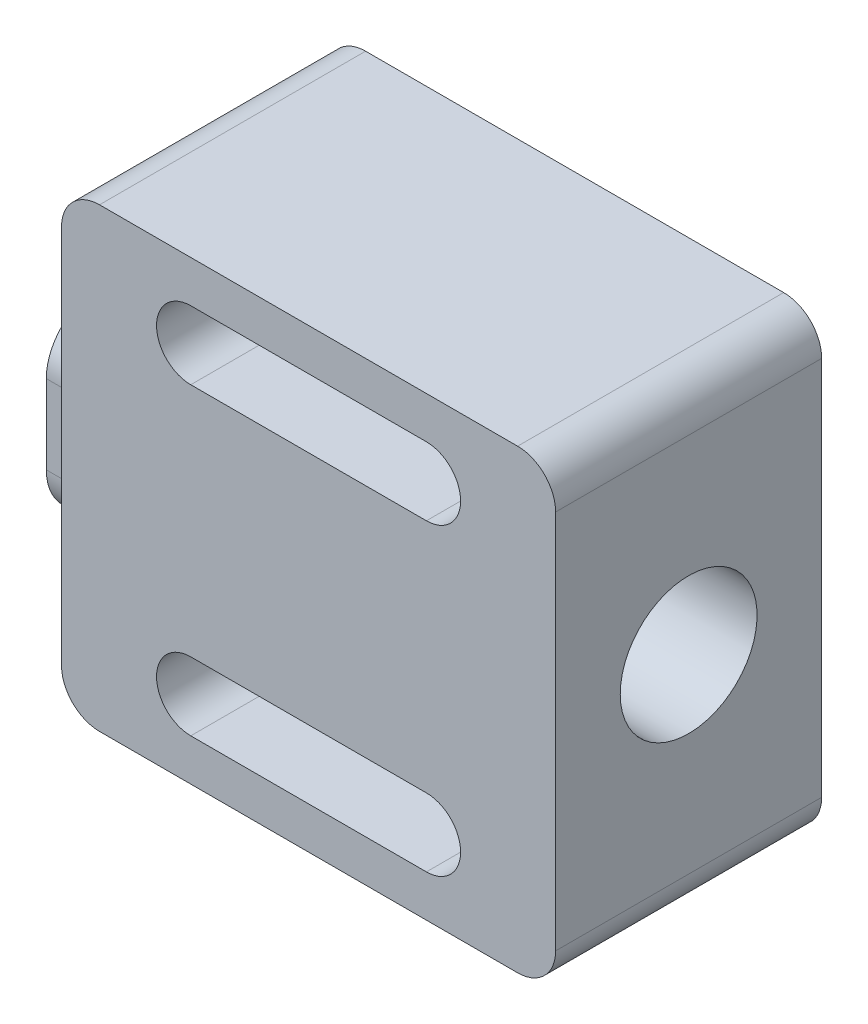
ISO-10303-21;
HEADER;
FILE_DESCRIPTION(('STEP AP214'),'2;1');
FILE_NAME('part.step','',(''),(''),'','','');
FILE_SCHEMA(('AUTOMOTIVE_DESIGN { 1 0 10303 214 1 1 1 1 }'));
ENDSEC;
DATA;
#1=APPLICATION_CONTEXT('core data for automotive mechanical design processes');
#2=APPLICATION_PROTOCOL_DEFINITION('international standard','automotive_design',2000,#1);
#3=PRODUCT_CONTEXT('',#1,'mechanical');
#4=PRODUCT('Part','Part','',(#3));
#5=PRODUCT_RELATED_PRODUCT_CATEGORY('part','',(#4));
#6=PRODUCT_DEFINITION_FORMATION('','',#4);
#7=PRODUCT_DEFINITION_CONTEXT('part definition',#1,'design');
#8=PRODUCT_DEFINITION('design','',#6,#7);
#9=PRODUCT_DEFINITION_SHAPE('','',#8);
#10=(LENGTH_UNIT() NAMED_UNIT(*) SI_UNIT(.MILLI.,.METRE.));
#11=(NAMED_UNIT(*) PLANE_ANGLE_UNIT() SI_UNIT($,.RADIAN.));
#12=(NAMED_UNIT(*) SI_UNIT($,.STERADIAN.) SOLID_ANGLE_UNIT());
#13=UNCERTAINTY_MEASURE_WITH_UNIT(LENGTH_MEASURE(1.E-05),#10,'distance_accuracy_value','');
#14=(GEOMETRIC_REPRESENTATION_CONTEXT(3) GLOBAL_UNCERTAINTY_ASSIGNED_CONTEXT((#13)) GLOBAL_UNIT_ASSIGNED_CONTEXT((#10,
#11,#12)) REPRESENTATION_CONTEXT('',''));
#15=CARTESIAN_POINT('',(0.,0.,0.));
#16=DIRECTION('',(0.,0.,1.));
#17=DIRECTION('',(1.,0.,0.));
#18=AXIS2_PLACEMENT_3D('',#15,#16,#17);
#19=CARTESIAN_POINT('',(-17.,45.,35.));
#20=DIRECTION('',(1.,0.,0.));
#21=DIRECTION('',(0.,0.,1.));
#22=AXIS2_PLACEMENT_3D('',#19,#20,#21);
#23=PLANE('',#22);
#24=DIRECTION('',(0.,-1.,0.));
#25=VECTOR('',#24,1.);
#26=CARTESIAN_POINT('',(-17.,45.,0.));
#27=LINE('',#26,#25);
#28=CARTESIAN_POINT('',(-17.,45.,0.));
#29=VERTEX_POINT('',#28);
#30=CARTESIAN_POINT('',(-17.,-5.,0.));
#31=VERTEX_POINT('',#30);
#32=EDGE_CURVE('E319',#29,#31,#27,.T.);
#33=ORIENTED_EDGE('',*,*,#32,.T.);
#34=DIRECTION('',(0.,0.,-1.));
#35=VECTOR('',#34,1.);
#36=CARTESIAN_POINT('',(-17.,-5.,35.));
#37=LINE('',#36,#35);
#38=CARTESIAN_POINT('',(-17.,-5.,35.));
#39=VERTEX_POINT('',#38);
#40=EDGE_CURVE('E339',#39,#31,#37,.T.);
#41=ORIENTED_EDGE('',*,*,#40,.F.);
#42=DIRECTION('',(0.,-1.,0.));
#43=VECTOR('',#42,1.);
#44=CARTESIAN_POINT('',(-17.,45.,35.));
#45=LINE('',#44,#43);
#46=CARTESIAN_POINT('',(-17.,45.,35.));
#47=VERTEX_POINT('',#46);
#48=EDGE_CURVE('E302',#47,#39,#45,.T.);
#49=ORIENTED_EDGE('',*,*,#48,.F.);
#50=DIRECTION('',(0.,0.,-1.));
#51=VECTOR('',#50,1.);
#52=CARTESIAN_POINT('',(-17.,45.,35.));
#53=LINE('',#52,#51);
#54=EDGE_CURVE('E342',#47,#29,#53,.T.);
#55=ORIENTED_EDGE('',*,*,#54,.T.);
#56=EDGE_LOOP('',(#33,#41,#49,#55));
#57=FACE_BOUND('',#56,.T.);
#58=CARTESIAN_POINT('',(-17.,25.1961524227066,26.5));
#59=DIRECTION('',(-1.,0.,0.));
#60=DIRECTION('',(0.,0.,-1.));
#61=AXIS2_PLACEMENT_3D('',#58,#59,#60);
#62=CIRCLE('',#61,7.);
#63=CARTESIAN_POINT('',(-17.,25.1961524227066,33.5));
#64=VERTEX_POINT('',#63);
#65=CARTESIAN_POINT('',(-17.,31.2583302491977,30.));
#66=VERTEX_POINT('',#65);
#67=EDGE_CURVE('E219',#64,#66,#62,.T.);
#68=ORIENTED_EDGE('',*,*,#67,.F.);
#69=DIRECTION('',(0.,1.,0.));
#70=VECTOR('',#69,1.);
#71=CARTESIAN_POINT('',(-17.,14.8038475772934,33.5));
#72=LINE('',#71,#70);
#73=CARTESIAN_POINT('',(-17.,14.8038475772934,33.5));
#74=VERTEX_POINT('',#73);
#75=EDGE_CURVE('E216',#74,#64,#72,.T.);
#76=ORIENTED_EDGE('',*,*,#75,.F.);
#77=CARTESIAN_POINT('',(-17.,14.8038475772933,26.5));
#78=DIRECTION('',(-1.,0.,0.));
#79=DIRECTION('',(0.,0.,1.));
#80=AXIS2_PLACEMENT_3D('',#77,#78,#79);
#81=CIRCLE('',#80,7.);
#82=CARTESIAN_POINT('',(-17.,8.7416697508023,30.));
#83=VERTEX_POINT('',#82);
#84=EDGE_CURVE('E718',#83,#74,#81,.T.);
#85=ORIENTED_EDGE('',*,*,#84,.F.);
#86=DIRECTION('',(0.,0.5,0.866025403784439));
#87=VECTOR('',#86,1.);
#88=CARTESIAN_POINT('',(-17.,3.5455173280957,21.));
#89=LINE('',#88,#87);
#90=CARTESIAN_POINT('',(-17.,3.5455173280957,21.));
#91=VERTEX_POINT('',#90);
#92=EDGE_CURVE('E773',#91,#83,#89,.T.);
#93=ORIENTED_EDGE('',*,*,#92,.F.);
#94=CARTESIAN_POINT('',(-17.,9.6076951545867,17.5));
#95=DIRECTION('',(-1.,0.,0.));
#96=DIRECTION('',(0.,0.,1.));
#97=AXIS2_PLACEMENT_3D('',#94,#95,#96);
#98=CIRCLE('',#97,7.);
#99=CARTESIAN_POINT('',(-17.,3.5455173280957,14.));
#100=VERTEX_POINT('',#99);
#101=EDGE_CURVE('E770',#100,#91,#98,.T.);
#102=ORIENTED_EDGE('',*,*,#101,.F.);
#103=DIRECTION('',(0.,-0.5,0.866025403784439));
#104=VECTOR('',#103,1.);
#105=CARTESIAN_POINT('',(-17.,8.7416697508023,5.));
#106=LINE('',#105,#104);
#107=CARTESIAN_POINT('',(-17.,8.7416697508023,5.));
#108=VERTEX_POINT('',#107);
#109=EDGE_CURVE('E767',#108,#100,#106,.T.);
#110=ORIENTED_EDGE('',*,*,#109,.F.);
#111=CARTESIAN_POINT('',(-17.,14.8038475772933,8.5));
#112=DIRECTION('',(-1.,0.,0.));
#113=DIRECTION('',(0.,0.,1.));
#114=AXIS2_PLACEMENT_3D('',#111,#112,#113);
#115=CIRCLE('',#114,7.);
#116=CARTESIAN_POINT('',(-17.,14.8038475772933,1.5));
#117=VERTEX_POINT('',#116);
#118=EDGE_CURVE('E764',#117,#108,#115,.T.);
#119=ORIENTED_EDGE('',*,*,#118,.F.);
#120=DIRECTION('',(0.,-1.,0.));
#121=VECTOR('',#120,1.);
#122=CARTESIAN_POINT('',(-17.,25.1961524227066,1.49999999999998));
#123=LINE('',#122,#121);
#124=CARTESIAN_POINT('',(-17.,25.1961524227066,1.49999999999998));
#125=VERTEX_POINT('',#124);
#126=EDGE_CURVE('E761',#125,#117,#123,.T.);
#127=ORIENTED_EDGE('',*,*,#126,.F.);
#128=CARTESIAN_POINT('',(-17.,25.1961524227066,8.5));
#129=DIRECTION('',(-1.,0.,0.));
#130=DIRECTION('',(0.,0.,1.));
#131=AXIS2_PLACEMENT_3D('',#128,#129,#130);
#132=CIRCLE('',#131,7.);
#133=CARTESIAN_POINT('',(-17.,31.2583302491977,5.));
#134=VERTEX_POINT('',#133);
#135=EDGE_CURVE('E754',#134,#125,#132,.T.);
#136=ORIENTED_EDGE('',*,*,#135,.F.);
#137=DIRECTION('',(0.,-0.5,-0.866025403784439));
#138=VECTOR('',#137,1.);
#139=CARTESIAN_POINT('',(-17.,36.4544826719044,14.));
#140=LINE('',#139,#138);
#141=CARTESIAN_POINT('',(-17.,36.4544826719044,14.));
#142=VERTEX_POINT('',#141);
#143=EDGE_CURVE('E751',#142,#134,#140,.T.);
#144=ORIENTED_EDGE('',*,*,#143,.F.);
#145=CARTESIAN_POINT('',(-17.,30.3923048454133,17.5));
#146=DIRECTION('',(-1.,0.,0.));
#147=DIRECTION('',(0.,0.,-1.));
#148=AXIS2_PLACEMENT_3D('',#145,#146,#147);
#149=CIRCLE('',#148,7.);
#150=CARTESIAN_POINT('',(-17.,36.4544826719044,21.));
#151=VERTEX_POINT('',#150);
#152=EDGE_CURVE('E34',#151,#142,#149,.T.);
#153=ORIENTED_EDGE('',*,*,#152,.F.);
#154=DIRECTION('',(0.,0.5,-0.866025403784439));
#155=VECTOR('',#154,1.);
#156=CARTESIAN_POINT('',(-17.,31.2583302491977,30.));
#157=LINE('',#156,#155);
#158=EDGE_CURVE('E29',#66,#151,#157,.T.);
#159=ORIENTED_EDGE('',*,*,#158,.F.);
#160=EDGE_LOOP('',(#68,#76,#85,#93,#102,#110,#119,#127,#136,#144,#153,#159));
#161=FACE_BOUND('',#160,.T.);
#162=ADVANCED_FACE('F14',(#57,#161),#23,.F.);
#163=CARTESIAN_POINT('',(43.,45.,35.));
#164=DIRECTION('',(0.,0.,1.));
#165=DIRECTION('',(0.,-1.,0.));
#166=AXIS2_PLACEMENT_3D('',#163,#164,#165);
#167=PLANE('',#166);
#168=DIRECTION('',(-1.,0.,0.));
#169=VECTOR('',#168,1.);
#170=CARTESIAN_POINT('',(31.,44.5,35.));
#171=LINE('',#170,#169);
#172=CARTESIAN_POINT('',(31.,44.5,35.));
#173=VERTEX_POINT('',#172);
#174=CARTESIAN_POINT('',(0.,44.5,35.));
#175=VERTEX_POINT('',#174);
#176=EDGE_CURVE('E265',#173,#175,#171,.T.);
#177=ORIENTED_EDGE('',*,*,#176,.F.);
#178=CARTESIAN_POINT('',(31.,40.,35.));
#179=DIRECTION('',(0.,0.,1.));
#180=DIRECTION('',(0.,-1.,0.));
#181=AXIS2_PLACEMENT_3D('',#178,#179,#180);
#182=CIRCLE('',#181,4.5);
#183=CARTESIAN_POINT('',(31.,35.5,35.));
#184=VERTEX_POINT('',#183);
#185=EDGE_CURVE('E263',#184,#173,#182,.T.);
#186=ORIENTED_EDGE('',*,*,#185,.F.);
#187=DIRECTION('',(1.,0.,0.));
#188=VECTOR('',#187,1.);
#189=CARTESIAN_POINT('',(31.,35.5,35.));
#190=LINE('',#189,#188);
#191=CARTESIAN_POINT('',(0.,35.5,35.));
#192=VERTEX_POINT('',#191);
#193=EDGE_CURVE('E271',#192,#184,#190,.T.);
#194=ORIENTED_EDGE('',*,*,#193,.F.);
#195=CARTESIAN_POINT('',(0.,40.,35.));
#196=DIRECTION('',(0.,0.,1.));
#197=DIRECTION('',(0.,-1.,0.));
#198=AXIS2_PLACEMENT_3D('',#195,#196,#197);
#199=CIRCLE('',#198,4.5);
#200=EDGE_CURVE('E268',#175,#192,#199,.T.);
#201=ORIENTED_EDGE('',*,*,#200,.F.);
#202=EDGE_LOOP('',(#177,#186,#194,#201));
#203=FACE_BOUND('',#202,.T.);
#204=CARTESIAN_POINT('',(43.,45.,35.));
#205=DIRECTION('',(0.,0.,1.));
#206=DIRECTION('',(0.,-1.,0.));
#207=AXIS2_PLACEMENT_3D('',#204,#205,#206);
#208=CIRCLE('',#207,5.);
#209=CARTESIAN_POINT('',(48.,45.,35.));
#210=VERTEX_POINT('',#209);
#211=CARTESIAN_POINT('',(43.,50.,35.));
#212=VERTEX_POINT('',#211);
#213=EDGE_CURVE('E294',#210,#212,#208,.T.);
#214=ORIENTED_EDGE('',*,*,#213,.T.);
#215=DIRECTION('',(-1.,0.,0.));
#216=VECTOR('',#215,1.);
#217=CARTESIAN_POINT('',(-12.,50.,35.));
#218=LINE('',#217,#216);
#219=CARTESIAN_POINT('',(-12.,50.,35.));
#220=VERTEX_POINT('',#219);
#221=EDGE_CURVE('E297',#212,#220,#218,.T.);
#222=ORIENTED_EDGE('',*,*,#221,.T.);
#223=CARTESIAN_POINT('',(-12.,45.,35.));
#224=DIRECTION('',(0.,0.,1.));
#225=DIRECTION('',(0.,-1.,0.));
#226=AXIS2_PLACEMENT_3D('',#223,#224,#225);
#227=CIRCLE('',#226,5.);
#228=EDGE_CURVE('E300',#220,#47,#227,.T.);
#229=ORIENTED_EDGE('',*,*,#228,.T.);
#230=ORIENTED_EDGE('',*,*,#48,.T.);
#231=CARTESIAN_POINT('',(-12.,-5.,35.));
#232=DIRECTION('',(0.,0.,1.));
#233=DIRECTION('',(0.,-1.,0.));
#234=AXIS2_PLACEMENT_3D('',#231,#232,#233);
#235=CIRCLE('',#234,5.);
#236=CARTESIAN_POINT('',(-12.,-10.,35.));
#237=VERTEX_POINT('',#236);
#238=EDGE_CURVE('E304',#39,#237,#235,.T.);
#239=ORIENTED_EDGE('',*,*,#238,.T.);
#240=DIRECTION('',(1.,0.,0.));
#241=VECTOR('',#240,1.);
#242=CARTESIAN_POINT('',(-12.,-10.,35.));
#243=LINE('',#242,#241);
#244=CARTESIAN_POINT('',(43.,-10.,35.));
#245=VERTEX_POINT('',#244);
#246=EDGE_CURVE('E306',#237,#245,#243,.T.);
#247=ORIENTED_EDGE('',*,*,#246,.T.);
#248=CARTESIAN_POINT('',(43.,-5.,35.));
#249=DIRECTION('',(0.,0.,1.));
#250=DIRECTION('',(0.,-1.,0.));
#251=AXIS2_PLACEMENT_3D('',#248,#249,#250);
#252=CIRCLE('',#251,5.);
#253=CARTESIAN_POINT('',(48.,-5.,35.));
#254=VERTEX_POINT('',#253);
#255=EDGE_CURVE('E308',#245,#254,#252,.T.);
#256=ORIENTED_EDGE('',*,*,#255,.T.);
#257=DIRECTION('',(0.,1.,0.));
#258=VECTOR('',#257,1.);
#259=CARTESIAN_POINT('',(48.,45.,35.));
#260=LINE('',#259,#258);
#261=EDGE_CURVE('E310',#254,#210,#260,.T.);
#262=ORIENTED_EDGE('',*,*,#261,.T.);
#263=EDGE_LOOP('',(#214,#222,#229,#230,#239,#247,#256,#262));
#264=FACE_BOUND('',#263,.T.);
#265=DIRECTION('',(1.,0.,0.));
#266=VECTOR('',#265,1.);
#267=CARTESIAN_POINT('',(31.,-4.5,35.));
#268=LINE('',#267,#266);
#269=CARTESIAN_POINT('',(0.,-4.5,35.));
#270=VERTEX_POINT('',#269);
#271=CARTESIAN_POINT('',(31.,-4.5,35.));
#272=VERTEX_POINT('',#271);
#273=EDGE_CURVE('E234',#270,#272,#268,.T.);
#274=ORIENTED_EDGE('',*,*,#273,.F.);
#275=CARTESIAN_POINT('',(0.,0.,35.));
#276=DIRECTION('',(0.,0.,1.));
#277=DIRECTION('',(0.,1.,0.));
#278=AXIS2_PLACEMENT_3D('',#275,#276,#277);
#279=CIRCLE('',#278,4.5);
#280=CARTESIAN_POINT('',(0.,4.5,35.));
#281=VERTEX_POINT('',#280);
#282=EDGE_CURVE('E232',#281,#270,#279,.T.);
#283=ORIENTED_EDGE('',*,*,#282,.F.);
#284=DIRECTION('',(-1.,0.,0.));
#285=VECTOR('',#284,1.);
#286=CARTESIAN_POINT('',(31.,4.5,35.));
#287=LINE('',#286,#285);
#288=CARTESIAN_POINT('',(31.,4.5,35.));
#289=VERTEX_POINT('',#288);
#290=EDGE_CURVE('E240',#289,#281,#287,.T.);
#291=ORIENTED_EDGE('',*,*,#290,.F.);
#292=CARTESIAN_POINT('',(31.,0.,35.));
#293=DIRECTION('',(0.,0.,1.));
#294=DIRECTION('',(0.,1.,0.));
#295=AXIS2_PLACEMENT_3D('',#292,#293,#294);
#296=CIRCLE('',#295,4.5);
#297=EDGE_CURVE('E237',#272,#289,#296,.T.);
#298=ORIENTED_EDGE('',*,*,#297,.F.);
#299=EDGE_LOOP('',(#274,#283,#291,#298));
#300=FACE_BOUND('',#299,.T.);
#301=ADVANCED_FACE('F368',(#203,#264,#300),#167,.T.);
#302=CARTESIAN_POINT('',(43.,45.,0.));
#303=DIRECTION('',(0.,0.,1.));
#304=DIRECTION('',(0.,-1.,0.));
#305=AXIS2_PLACEMENT_3D('',#302,#303,#304);
#306=PLANE('',#305);
#307=CARTESIAN_POINT('',(31.,40.,0.));
#308=DIRECTION('',(0.,0.,1.));
#309=DIRECTION('',(0.,-1.,0.));
#310=AXIS2_PLACEMENT_3D('',#307,#308,#309);
#311=CIRCLE('',#310,4.5);
#312=CARTESIAN_POINT('',(31.,35.5,0.));
#313=VERTEX_POINT('',#312);
#314=CARTESIAN_POINT('',(31.,44.5,0.));
#315=VERTEX_POINT('',#314);
#316=EDGE_CURVE('E262',#313,#315,#311,.T.);
#317=ORIENTED_EDGE('',*,*,#316,.T.);
#318=DIRECTION('',(-1.,0.,0.));
#319=VECTOR('',#318,1.);
#320=CARTESIAN_POINT('',(31.,44.5,0.));
#321=LINE('',#320,#319);
#322=CARTESIAN_POINT('',(0.,44.5,0.));
#323=VERTEX_POINT('',#322);
#324=EDGE_CURVE('E276',#315,#323,#321,.T.);
#325=ORIENTED_EDGE('',*,*,#324,.T.);
#326=CARTESIAN_POINT('',(0.,40.,0.));
#327=DIRECTION('',(0.,0.,1.));
#328=DIRECTION('',(0.,-1.,0.));
#329=AXIS2_PLACEMENT_3D('',#326,#327,#328);
#330=CIRCLE('',#329,4.5);
#331=CARTESIAN_POINT('',(0.,35.5,0.));
#332=VERTEX_POINT('',#331);
#333=EDGE_CURVE('E279',#323,#332,#330,.T.);
#334=ORIENTED_EDGE('',*,*,#333,.T.);
#335=DIRECTION('',(1.,0.,0.));
#336=VECTOR('',#335,1.);
#337=CARTESIAN_POINT('',(31.,35.5,0.));
#338=LINE('',#337,#336);
#339=EDGE_CURVE('E266',#332,#313,#338,.T.);
#340=ORIENTED_EDGE('',*,*,#339,.T.);
#341=EDGE_LOOP('',(#317,#325,#334,#340));
#342=FACE_BOUND('',#341,.T.);
#343=CARTESIAN_POINT('',(43.,45.,0.));
#344=DIRECTION('',(0.,0.,1.));
#345=DIRECTION('',(0.,-1.,0.));
#346=AXIS2_PLACEMENT_3D('',#343,#344,#345);
#347=CIRCLE('',#346,5.);
#348=CARTESIAN_POINT('',(48.,45.,0.));
#349=VERTEX_POINT('',#348);
#350=CARTESIAN_POINT('',(43.,50.,0.));
#351=VERTEX_POINT('',#350);
#352=EDGE_CURVE('E293',#349,#351,#347,.T.);
#353=ORIENTED_EDGE('',*,*,#352,.F.);
#354=DIRECTION('',(0.,1.,0.));
#355=VECTOR('',#354,1.);
#356=CARTESIAN_POINT('',(48.,45.,0.));
#357=LINE('',#356,#355);
#358=CARTESIAN_POINT('',(48.,-5.,0.));
#359=VERTEX_POINT('',#358);
#360=EDGE_CURVE('E298',#359,#349,#357,.T.);
#361=ORIENTED_EDGE('',*,*,#360,.F.);
#362=CARTESIAN_POINT('',(43.,-5.,0.));
#363=DIRECTION('',(0.,0.,1.));
#364=DIRECTION('',(0.,-1.,0.));
#365=AXIS2_PLACEMENT_3D('',#362,#363,#364);
#366=CIRCLE('',#365,5.);
#367=CARTESIAN_POINT('',(43.,-10.,0.));
#368=VERTEX_POINT('',#367);
#369=EDGE_CURVE('E325',#368,#359,#366,.T.);
#370=ORIENTED_EDGE('',*,*,#369,.F.);
#371=DIRECTION('',(1.,0.,0.));
#372=VECTOR('',#371,1.);
#373=CARTESIAN_POINT('',(-12.,-10.,0.));
#374=LINE('',#373,#372);
#375=CARTESIAN_POINT('',(-12.,-10.,0.));
#376=VERTEX_POINT('',#375);
#377=EDGE_CURVE('E323',#376,#368,#374,.T.);
#378=ORIENTED_EDGE('',*,*,#377,.F.);
#379=CARTESIAN_POINT('',(-12.,-5.,0.));
#380=DIRECTION('',(0.,0.,1.));
#381=DIRECTION('',(0.,-1.,0.));
#382=AXIS2_PLACEMENT_3D('',#379,#380,#381);
#383=CIRCLE('',#382,5.);
#384=EDGE_CURVE('E321',#31,#376,#383,.T.);
#385=ORIENTED_EDGE('',*,*,#384,.F.);
#386=ORIENTED_EDGE('',*,*,#32,.F.);
#387=CARTESIAN_POINT('',(-12.,45.,0.));
#388=DIRECTION('',(0.,0.,1.));
#389=DIRECTION('',(0.,-1.,0.));
#390=AXIS2_PLACEMENT_3D('',#387,#388,#389);
#391=CIRCLE('',#390,5.);
#392=CARTESIAN_POINT('',(-12.,50.,0.));
#393=VERTEX_POINT('',#392);
#394=EDGE_CURVE('E317',#393,#29,#391,.T.);
#395=ORIENTED_EDGE('',*,*,#394,.F.);
#396=DIRECTION('',(-1.,0.,0.));
#397=VECTOR('',#396,1.);
#398=CARTESIAN_POINT('',(-12.,50.,0.));
#399=LINE('',#398,#397);
#400=EDGE_CURVE('E315',#351,#393,#399,.T.);
#401=ORIENTED_EDGE('',*,*,#400,.F.);
#402=EDGE_LOOP('',(#353,#361,#370,#378,#385,#386,#395,#401));
#403=FACE_BOUND('',#402,.T.);
#404=CARTESIAN_POINT('',(0.,0.,0.));
#405=DIRECTION('',(0.,0.,1.));
#406=DIRECTION('',(0.,1.,0.));
#407=AXIS2_PLACEMENT_3D('',#404,#405,#406);
#408=CIRCLE('',#407,4.5);
#409=CARTESIAN_POINT('',(0.,4.5,0.));
#410=VERTEX_POINT('',#409);
#411=CARTESIAN_POINT('',(0.,-4.5,0.));
#412=VERTEX_POINT('',#411);
#413=EDGE_CURVE('E230',#410,#412,#408,.T.);
#414=ORIENTED_EDGE('',*,*,#413,.T.);
#415=DIRECTION('',(1.,0.,0.));
#416=VECTOR('',#415,1.);
#417=CARTESIAN_POINT('',(31.,-4.5,0.));
#418=LINE('',#417,#416);
#419=CARTESIAN_POINT('',(31.,-4.5,0.));
#420=VERTEX_POINT('',#419);
#421=EDGE_CURVE('E245',#412,#420,#418,.T.);
#422=ORIENTED_EDGE('',*,*,#421,.T.);
#423=CARTESIAN_POINT('',(31.,0.,0.));
#424=DIRECTION('',(0.,0.,1.));
#425=DIRECTION('',(0.,1.,0.));
#426=AXIS2_PLACEMENT_3D('',#423,#424,#425);
#427=CIRCLE('',#426,4.5);
#428=CARTESIAN_POINT('',(31.,4.5,0.));
#429=VERTEX_POINT('',#428);
#430=EDGE_CURVE('E248',#420,#429,#427,.T.);
#431=ORIENTED_EDGE('',*,*,#430,.T.);
#432=DIRECTION('',(-1.,0.,0.));
#433=VECTOR('',#432,1.);
#434=CARTESIAN_POINT('',(31.,4.5,0.));
#435=LINE('',#434,#433);
#436=EDGE_CURVE('E235',#429,#410,#435,.T.);
#437=ORIENTED_EDGE('',*,*,#436,.T.);
#438=EDGE_LOOP('',(#414,#422,#431,#437));
#439=FACE_BOUND('',#438,.T.);
#440=ADVANCED_FACE('F355',(#342,#403,#439),#306,.F.);
#441=CARTESIAN_POINT('',(43.,45.,35.));
#442=DIRECTION('',(0.,0.,-1.));
#443=DIRECTION('',(0.,1.,0.));
#444=AXIS2_PLACEMENT_3D('',#441,#442,#443);
#445=CYLINDRICAL_SURFACE('',#444,5.);
#446=ORIENTED_EDGE('',*,*,#352,.T.);
#447=DIRECTION('',(0.,0.,-1.));
#448=VECTOR('',#447,1.);
#449=CARTESIAN_POINT('',(43.,50.,35.));
#450=LINE('',#449,#448);
#451=EDGE_CURVE('E9',#212,#351,#450,.T.);
#452=ORIENTED_EDGE('',*,*,#451,.F.);
#453=ORIENTED_EDGE('',*,*,#213,.F.);
#454=DIRECTION('',(0.,0.,-1.));
#455=VECTOR('',#454,1.);
#456=CARTESIAN_POINT('',(48.,45.,35.));
#457=LINE('',#456,#455);
#458=EDGE_CURVE('E312',#210,#349,#457,.T.);
#459=ORIENTED_EDGE('',*,*,#458,.T.);
#460=EDGE_LOOP('',(#446,#452,#453,#459));
#461=FACE_BOUND('',#460,.T.);
#462=ADVANCED_FACE('F16',(#461),#445,.T.);
#463=CARTESIAN_POINT('',(-12.,50.,35.));
#464=DIRECTION('',(0.,-1.,0.));
#465=DIRECTION('',(0.,0.,-1.));
#466=AXIS2_PLACEMENT_3D('',#463,#464,#465);
#467=PLANE('',#466);
#468=ORIENTED_EDGE('',*,*,#400,.T.);
#469=DIRECTION('',(0.,0.,-1.));
#470=VECTOR('',#469,1.);
#471=CARTESIAN_POINT('',(-12.,50.,35.));
#472=LINE('',#471,#470);
#473=EDGE_CURVE('E22',#220,#393,#472,.T.);
#474=ORIENTED_EDGE('',*,*,#473,.F.);
#475=ORIENTED_EDGE('',*,*,#221,.F.);
#476=ORIENTED_EDGE('',*,*,#451,.T.);
#477=EDGE_LOOP('',(#468,#474,#475,#476));
#478=FACE_BOUND('',#477,.T.);
#479=ADVANCED_FACE('F373',(#478),#467,.F.);
#480=CARTESIAN_POINT('',(-12.,45.,35.));
#481=DIRECTION('',(0.,0.,-1.));
#482=DIRECTION('',(0.,1.,0.));
#483=AXIS2_PLACEMENT_3D('',#480,#481,#482);
#484=CYLINDRICAL_SURFACE('',#483,5.);
#485=ORIENTED_EDGE('',*,*,#394,.T.);
#486=ORIENTED_EDGE('',*,*,#54,.F.);
#487=ORIENTED_EDGE('',*,*,#228,.F.);
#488=ORIENTED_EDGE('',*,*,#473,.T.);
#489=EDGE_LOOP('',(#485,#486,#487,#488));
#490=FACE_BOUND('',#489,.T.);
#491=ADVANCED_FACE('F349',(#490),#484,.T.);
#492=CARTESIAN_POINT('',(-12.,-5.,35.));
#493=DIRECTION('',(0.,0.,-1.));
#494=DIRECTION('',(0.,1.,0.));
#495=AXIS2_PLACEMENT_3D('',#492,#493,#494);
#496=CYLINDRICAL_SURFACE('',#495,5.);
#497=ORIENTED_EDGE('',*,*,#384,.T.);
#498=DIRECTION('',(0.,0.,-1.));
#499=VECTOR('',#498,1.);
#500=CARTESIAN_POINT('',(-12.,-10.,35.));
#501=LINE('',#500,#499);
#502=EDGE_CURVE('E336',#237,#376,#501,.T.);
#503=ORIENTED_EDGE('',*,*,#502,.F.);
#504=ORIENTED_EDGE('',*,*,#238,.F.);
#505=ORIENTED_EDGE('',*,*,#40,.T.);
#506=EDGE_LOOP('',(#497,#503,#504,#505));
#507=FACE_BOUND('',#506,.T.);
#508=ADVANCED_FACE('F364',(#507),#496,.T.);
#509=CARTESIAN_POINT('',(-12.,-10.,35.));
#510=DIRECTION('',(0.,1.,0.));
#511=DIRECTION('',(0.,0.,1.));
#512=AXIS2_PLACEMENT_3D('',#509,#510,#511);
#513=PLANE('',#512);
#514=ORIENTED_EDGE('',*,*,#377,.T.);
#515=DIRECTION('',(0.,0.,-1.));
#516=VECTOR('',#515,1.);
#517=CARTESIAN_POINT('',(43.,-10.,35.));
#518=LINE('',#517,#516);
#519=EDGE_CURVE('E333',#245,#368,#518,.T.);
#520=ORIENTED_EDGE('',*,*,#519,.F.);
#521=ORIENTED_EDGE('',*,*,#246,.F.);
#522=ORIENTED_EDGE('',*,*,#502,.T.);
#523=EDGE_LOOP('',(#514,#520,#521,#522));
#524=FACE_BOUND('',#523,.T.);
#525=ADVANCED_FACE('F386',(#524),#513,.F.);
#526=CARTESIAN_POINT('',(43.,-5.,35.));
#527=DIRECTION('',(0.,0.,-1.));
#528=DIRECTION('',(0.,1.,0.));
#529=AXIS2_PLACEMENT_3D('',#526,#527,#528);
#530=CYLINDRICAL_SURFACE('',#529,5.);
#531=ORIENTED_EDGE('',*,*,#369,.T.);
#532=DIRECTION('',(0.,0.,-1.));
#533=VECTOR('',#532,1.);
#534=CARTESIAN_POINT('',(48.,-5.,35.));
#535=LINE('',#534,#533);
#536=EDGE_CURVE('E330',#254,#359,#535,.T.);
#537=ORIENTED_EDGE('',*,*,#536,.F.);
#538=ORIENTED_EDGE('',*,*,#255,.F.);
#539=ORIENTED_EDGE('',*,*,#519,.T.);
#540=EDGE_LOOP('',(#531,#537,#538,#539));
#541=FACE_BOUND('',#540,.T.);
#542=ADVANCED_FACE('F384',(#541),#530,.T.);
#543=CARTESIAN_POINT('',(48.,45.,35.));
#544=DIRECTION('',(-1.,0.,0.));
#545=DIRECTION('',(0.,0.,-1.));
#546=AXIS2_PLACEMENT_3D('',#543,#544,#545);
#547=PLANE('',#546);
#548=CARTESIAN_POINT('',(48.,20.,17.5));
#549=DIRECTION('',(1.,0.,0.));
#550=DIRECTION('',(0.,0.,1.));
#551=AXIS2_PLACEMENT_3D('',#548,#549,#550);
#552=CIRCLE('',#551,9.);
#553=CARTESIAN_POINT('',(48.,20.,26.5));
#554=VERTEX_POINT('',#553);
#555=EDGE_CURVE('E220',#554,#554,#552,.T.);
#556=ORIENTED_EDGE('',*,*,#555,.F.);
#557=EDGE_LOOP('',(#556));
#558=FACE_BOUND('',#557,.T.);
#559=ORIENTED_EDGE('',*,*,#360,.T.);
#560=ORIENTED_EDGE('',*,*,#458,.F.);
#561=ORIENTED_EDGE('',*,*,#261,.F.);
#562=ORIENTED_EDGE('',*,*,#536,.T.);
#563=EDGE_LOOP('',(#559,#560,#561,#562));
#564=FACE_BOUND('',#563,.T.);
#565=ADVANCED_FACE('F379',(#558,#564),#547,.F.);
#566=CARTESIAN_POINT('',(31.,40.,35.));
#567=DIRECTION('',(0.,0.,-1.));
#568=DIRECTION('',(0.,1.,0.));
#569=AXIS2_PLACEMENT_3D('',#566,#567,#568);
#570=CYLINDRICAL_SURFACE('',#569,4.5);
#571=ORIENTED_EDGE('',*,*,#316,.F.);
#572=DIRECTION('',(0.,0.,-1.));
#573=VECTOR('',#572,1.);
#574=CARTESIAN_POINT('',(31.,35.5,35.));
#575=LINE('',#574,#573);
#576=EDGE_CURVE('E273',#184,#313,#575,.T.);
#577=ORIENTED_EDGE('',*,*,#576,.F.);
#578=ORIENTED_EDGE('',*,*,#185,.T.);
#579=DIRECTION('',(0.,0.,-1.));
#580=VECTOR('',#579,1.);
#581=CARTESIAN_POINT('',(31.,44.5,35.));
#582=LINE('',#581,#580);
#583=EDGE_CURVE('E290',#173,#315,#582,.T.);
#584=ORIENTED_EDGE('',*,*,#583,.T.);
#585=EDGE_LOOP('',(#571,#577,#578,#584));
#586=FACE_BOUND('',#585,.T.);
#587=ADVANCED_FACE('F424',(#586),#570,.F.);
#588=CARTESIAN_POINT('',(31.,44.5,35.));
#589=DIRECTION('',(0.,-1.,0.));
#590=DIRECTION('',(1.,0.,0.));
#591=AXIS2_PLACEMENT_3D('',#588,#589,#590);
#592=PLANE('',#591);
#593=ORIENTED_EDGE('',*,*,#324,.F.);
#594=ORIENTED_EDGE('',*,*,#583,.F.);
#595=ORIENTED_EDGE('',*,*,#176,.T.);
#596=DIRECTION('',(0.,0.,-1.));
#597=VECTOR('',#596,1.);
#598=CARTESIAN_POINT('',(0.,44.5,35.));
#599=LINE('',#598,#597);
#600=EDGE_CURVE('E288',#175,#323,#599,.T.);
#601=ORIENTED_EDGE('',*,*,#600,.T.);
#602=EDGE_LOOP('',(#593,#594,#595,#601));
#603=FACE_BOUND('',#602,.T.);
#604=ADVANCED_FACE('F430',(#603),#592,.T.);
#605=CARTESIAN_POINT('',(0.,40.,35.));
#606=DIRECTION('',(0.,0.,-1.));
#607=DIRECTION('',(0.,1.,0.));
#608=AXIS2_PLACEMENT_3D('',#605,#606,#607);
#609=CYLINDRICAL_SURFACE('',#608,4.5);
#610=ORIENTED_EDGE('',*,*,#333,.F.);
#611=ORIENTED_EDGE('',*,*,#600,.F.);
#612=ORIENTED_EDGE('',*,*,#200,.T.);
#613=DIRECTION('',(0.,0.,-1.));
#614=VECTOR('',#613,1.);
#615=CARTESIAN_POINT('',(0.,35.5,35.));
#616=LINE('',#615,#614);
#617=EDGE_CURVE('E286',#192,#332,#616,.T.);
#618=ORIENTED_EDGE('',*,*,#617,.T.);
#619=EDGE_LOOP('',(#610,#611,#612,#618));
#620=FACE_BOUND('',#619,.T.);
#621=ADVANCED_FACE('F467',(#620),#609,.F.);
#622=CARTESIAN_POINT('',(31.,35.5,35.));
#623=DIRECTION('',(0.,1.,0.));
#624=DIRECTION('',(-1.,0.,0.));
#625=AXIS2_PLACEMENT_3D('',#622,#623,#624);
#626=PLANE('',#625);
#627=ORIENTED_EDGE('',*,*,#339,.F.);
#628=ORIENTED_EDGE('',*,*,#617,.F.);
#629=ORIENTED_EDGE('',*,*,#193,.T.);
#630=ORIENTED_EDGE('',*,*,#576,.T.);
#631=EDGE_LOOP('',(#627,#628,#629,#630));
#632=FACE_BOUND('',#631,.T.);
#633=ADVANCED_FACE('F463',(#632),#626,.T.);
#634=CARTESIAN_POINT('',(0.,0.,35.));
#635=DIRECTION('',(0.,0.,-1.));
#636=DIRECTION('',(0.,1.,0.));
#637=AXIS2_PLACEMENT_3D('',#634,#635,#636);
#638=CYLINDRICAL_SURFACE('',#637,4.5);
#639=ORIENTED_EDGE('',*,*,#413,.F.);
#640=DIRECTION('',(0.,0.,-1.));
#641=VECTOR('',#640,1.);
#642=CARTESIAN_POINT('',(0.,4.5,35.));
#643=LINE('',#642,#641);
#644=EDGE_CURVE('E242',#281,#410,#643,.T.);
#645=ORIENTED_EDGE('',*,*,#644,.F.);
#646=ORIENTED_EDGE('',*,*,#282,.T.);
#647=DIRECTION('',(0.,0.,-1.));
#648=VECTOR('',#647,1.);
#649=CARTESIAN_POINT('',(0.,-4.5,35.));
#650=LINE('',#649,#648);
#651=EDGE_CURVE('E259',#270,#412,#650,.T.);
#652=ORIENTED_EDGE('',*,*,#651,.T.);
#653=EDGE_LOOP('',(#639,#645,#646,#652));
#654=FACE_BOUND('',#653,.T.);
#655=ADVANCED_FACE('F459',(#654),#638,.F.);
#656=CARTESIAN_POINT('',(31.,-4.5,35.));
#657=DIRECTION('',(0.,1.,0.));
#658=DIRECTION('',(-1.,0.,0.));
#659=AXIS2_PLACEMENT_3D('',#656,#657,#658);
#660=PLANE('',#659);
#661=ORIENTED_EDGE('',*,*,#421,.F.);
#662=ORIENTED_EDGE('',*,*,#651,.F.);
#663=ORIENTED_EDGE('',*,*,#273,.T.);
#664=DIRECTION('',(0.,0.,-1.));
#665=VECTOR('',#664,1.);
#666=CARTESIAN_POINT('',(31.,-4.5,35.));
#667=LINE('',#666,#665);
#668=EDGE_CURVE('E257',#272,#420,#667,.T.);
#669=ORIENTED_EDGE('',*,*,#668,.T.);
#670=EDGE_LOOP('',(#661,#662,#663,#669));
#671=FACE_BOUND('',#670,.T.);
#672=ADVANCED_FACE('F455',(#671),#660,.T.);
#673=CARTESIAN_POINT('',(31.,0.,35.));
#674=DIRECTION('',(0.,0.,-1.));
#675=DIRECTION('',(0.,1.,0.));
#676=AXIS2_PLACEMENT_3D('',#673,#674,#675);
#677=CYLINDRICAL_SURFACE('',#676,4.5);
#678=ORIENTED_EDGE('',*,*,#430,.F.);
#679=ORIENTED_EDGE('',*,*,#668,.F.);
#680=ORIENTED_EDGE('',*,*,#297,.T.);
#681=DIRECTION('',(0.,0.,-1.));
#682=VECTOR('',#681,1.);
#683=CARTESIAN_POINT('',(31.,4.5,35.));
#684=LINE('',#683,#682);
#685=EDGE_CURVE('E255',#289,#429,#684,.T.);
#686=ORIENTED_EDGE('',*,*,#685,.T.);
#687=EDGE_LOOP('',(#678,#679,#680,#686));
#688=FACE_BOUND('',#687,.T.);
#689=ADVANCED_FACE('F447',(#688),#677,.F.);
#690=CARTESIAN_POINT('',(31.,4.5,35.));
#691=DIRECTION('',(0.,-1.,0.));
#692=DIRECTION('',(1.,0.,0.));
#693=AXIS2_PLACEMENT_3D('',#690,#691,#692);
#694=PLANE('',#693);
#695=ORIENTED_EDGE('',*,*,#436,.F.);
#696=ORIENTED_EDGE('',*,*,#685,.F.);
#697=ORIENTED_EDGE('',*,*,#290,.T.);
#698=ORIENTED_EDGE('',*,*,#644,.T.);
#699=EDGE_LOOP('',(#695,#696,#697,#698));
#700=FACE_BOUND('',#699,.T.);
#701=ADVANCED_FACE('F437',(#700),#694,.T.);
#702=CARTESIAN_POINT('',(-2.,20.,17.5));
#703=DIRECTION('',(1.,0.,0.));
#704=DIRECTION('',(0.,0.,1.));
#705=AXIS2_PLACEMENT_3D('',#702,#703,#704);
#706=CYLINDRICAL_SURFACE('',#705,9.);
#707=CARTESIAN_POINT('',(-2.,20.,17.5));
#708=DIRECTION('',(1.,0.,0.));
#709=DIRECTION('',(0.,0.,1.));
#710=AXIS2_PLACEMENT_3D('',#707,#708,#709);
#711=CIRCLE('',#710,9.);
#712=CARTESIAN_POINT('',(-2.,20.,26.5));
#713=VERTEX_POINT('',#712);
#714=EDGE_CURVE('E223',#713,#713,#711,.T.);
#715=ORIENTED_EDGE('',*,*,#714,.F.);
#716=EDGE_LOOP('',(#715));
#717=FACE_BOUND('',#716,.T.);
#718=ORIENTED_EDGE('',*,*,#555,.T.);
#719=EDGE_LOOP('',(#718));
#720=FACE_BOUND('',#719,.T.);
#721=ADVANCED_FACE('F434',(#717,#720),#706,.F.);
#722=CARTESIAN_POINT('',(-2.,20.,17.5));
#723=DIRECTION('',(1.,0.,0.));
#724=DIRECTION('',(0.,0.,1.));
#725=AXIS2_PLACEMENT_3D('',#722,#723,#724);
#726=PLANE('',#725);
#727=ORIENTED_EDGE('',*,*,#714,.T.);
#728=EDGE_LOOP('',(#727));
#729=FACE_BOUND('',#728,.T.);
#730=ADVANCED_FACE('F436',(#729),#726,.T.);
#731=CARTESIAN_POINT('',(-20.5,25.1961524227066,26.5));
#732=DIRECTION('',(1.,0.,0.));
#733=DIRECTION('',(0.,0.,1.));
#734=AXIS2_PLACEMENT_3D('',#731,#732,#733);
#735=CYLINDRICAL_SURFACE('',#734,7.);
#736=ORIENTED_EDGE('',*,*,#67,.T.);
#737=DIRECTION('',(1.,0.,0.));
#738=VECTOR('',#737,1.);
#739=CARTESIAN_POINT('',(-20.5,31.2583302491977,30.));
#740=LINE('',#739,#738);
#741=CARTESIAN_POINT('',(-20.5,31.2583302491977,30.));
#742=VERTEX_POINT('',#741);
#743=EDGE_CURVE('E200',#742,#66,#740,.T.);
#744=ORIENTED_EDGE('',*,*,#743,.F.);
#745=CARTESIAN_POINT('',(-20.5,25.1961524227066,26.5));
#746=DIRECTION('',(-1.,0.,0.));
#747=DIRECTION('',(0.,0.,-1.));
#748=AXIS2_PLACEMENT_3D('',#745,#746,#747);
#749=CIRCLE('',#748,7.);
#750=CARTESIAN_POINT('',(-20.5,25.1961524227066,33.5));
#751=VERTEX_POINT('',#750);
#752=EDGE_CURVE('E207',#751,#742,#749,.T.);
#753=ORIENTED_EDGE('',*,*,#752,.F.);
#754=DIRECTION('',(1.,0.,0.));
#755=VECTOR('',#754,1.);
#756=CARTESIAN_POINT('',(-20.5,25.1961524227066,33.5));
#757=LINE('',#756,#755);
#758=EDGE_CURVE('E714',#751,#64,#757,.T.);
#759=ORIENTED_EDGE('',*,*,#758,.T.);
#760=EDGE_LOOP('',(#736,#744,#753,#759));
#761=FACE_BOUND('',#760,.T.);
#762=ADVANCED_FACE('F218',(#761),#735,.T.);
#763=CARTESIAN_POINT('',(-20.5,31.2583302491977,30.));
#764=DIRECTION('',(0.,-0.866025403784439,-0.5));
#765=DIRECTION('',(0.,0.5,-0.866025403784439));
#766=AXIS2_PLACEMENT_3D('',#763,#764,#765);
#767=PLANE('',#766);
#768=ORIENTED_EDGE('',*,*,#158,.T.);
#769=DIRECTION('',(1.,0.,0.));
#770=VECTOR('',#769,1.);
#771=CARTESIAN_POINT('',(-20.5,36.4544826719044,21.));
#772=LINE('',#771,#770);
#773=CARTESIAN_POINT('',(-20.5,36.4544826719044,21.));
#774=VERTEX_POINT('',#773);
#775=EDGE_CURVE('E203',#774,#151,#772,.T.);
#776=ORIENTED_EDGE('',*,*,#775,.F.);
#777=DIRECTION('',(0.,0.5,-0.866025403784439));
#778=VECTOR('',#777,1.);
#779=CARTESIAN_POINT('',(-20.5,31.2583302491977,30.));
#780=LINE('',#779,#778);
#781=EDGE_CURVE('E196',#742,#774,#780,.T.);
#782=ORIENTED_EDGE('',*,*,#781,.F.);
#783=ORIENTED_EDGE('',*,*,#743,.T.);
#784=EDGE_LOOP('',(#768,#776,#782,#783));
#785=FACE_BOUND('',#784,.T.);
#786=ADVANCED_FACE('F198',(#785),#767,.F.);
#787=CARTESIAN_POINT('',(-20.5,30.3923048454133,17.5));
#788=DIRECTION('',(1.,0.,0.));
#789=DIRECTION('',(0.,0.,1.));
#790=AXIS2_PLACEMENT_3D('',#787,#788,#789);
#791=CYLINDRICAL_SURFACE('',#790,7.);
#792=ORIENTED_EDGE('',*,*,#152,.T.);
#793=DIRECTION('',(1.,0.,0.));
#794=VECTOR('',#793,1.);
#795=CARTESIAN_POINT('',(-20.5,36.4544826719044,14.));
#796=LINE('',#795,#794);
#797=CARTESIAN_POINT('',(-20.5,36.4544826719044,14.));
#798=VERTEX_POINT('',#797);
#799=EDGE_CURVE('E225',#798,#142,#796,.T.);
#800=ORIENTED_EDGE('',*,*,#799,.F.);
#801=CARTESIAN_POINT('',(-20.5,30.3923048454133,17.5));
#802=DIRECTION('',(-1.,0.,0.));
#803=DIRECTION('',(0.,0.,-1.));
#804=AXIS2_PLACEMENT_3D('',#801,#802,#803);
#805=CIRCLE('',#804,7.);
#806=EDGE_CURVE('E206',#774,#798,#805,.T.);
#807=ORIENTED_EDGE('',*,*,#806,.F.);
#808=ORIENTED_EDGE('',*,*,#775,.T.);
#809=EDGE_LOOP('',(#792,#800,#807,#808));
#810=FACE_BOUND('',#809,.T.);
#811=ADVANCED_FACE('F600',(#810),#791,.T.);
#812=CARTESIAN_POINT('',(-20.5,36.4544826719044,14.));
#813=DIRECTION('',(0.,-0.866025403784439,0.5));
#814=DIRECTION('',(0.,-0.5,-0.866025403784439));
#815=AXIS2_PLACEMENT_3D('',#812,#813,#814);
#816=PLANE('',#815);
#817=ORIENTED_EDGE('',*,*,#143,.T.);
#818=DIRECTION('',(1.,0.,0.));
#819=VECTOR('',#818,1.);
#820=CARTESIAN_POINT('',(-20.5,31.2583302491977,5.));
#821=LINE('',#820,#819);
#822=CARTESIAN_POINT('',(-20.5,31.2583302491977,5.));
#823=VERTEX_POINT('',#822);
#824=EDGE_CURVE('E744',#823,#134,#821,.T.);
#825=ORIENTED_EDGE('',*,*,#824,.F.);
#826=DIRECTION('',(0.,-0.5,-0.866025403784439));
#827=VECTOR('',#826,1.);
#828=CARTESIAN_POINT('',(-20.5,36.4544826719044,14.));
#829=LINE('',#828,#827);
#830=EDGE_CURVE('E752',#798,#823,#829,.T.);
#831=ORIENTED_EDGE('',*,*,#830,.F.);
#832=ORIENTED_EDGE('',*,*,#799,.T.);
#833=EDGE_LOOP('',(#817,#825,#831,#832));
#834=FACE_BOUND('',#833,.T.);
#835=ADVANCED_FACE('F608',(#834),#816,.F.);
#836=CARTESIAN_POINT('',(-20.5,25.1961524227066,8.5));
#837=DIRECTION('',(1.,0.,0.));
#838=DIRECTION('',(0.,0.,1.));
#839=AXIS2_PLACEMENT_3D('',#836,#837,#838);
#840=CYLINDRICAL_SURFACE('',#839,7.);
#841=ORIENTED_EDGE('',*,*,#135,.T.);
#842=DIRECTION('',(1.,0.,0.));
#843=VECTOR('',#842,1.);
#844=CARTESIAN_POINT('',(-20.5,25.1961524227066,1.49999999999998));
#845=LINE('',#844,#843);
#846=CARTESIAN_POINT('',(-20.5,25.1961524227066,1.49999999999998));
#847=VERTEX_POINT('',#846);
#848=EDGE_CURVE('E741',#847,#125,#845,.T.);
#849=ORIENTED_EDGE('',*,*,#848,.F.);
#850=CARTESIAN_POINT('',(-20.5,25.1961524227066,8.5));
#851=DIRECTION('',(-1.,0.,0.));
#852=DIRECTION('',(0.,0.,1.));
#853=AXIS2_PLACEMENT_3D('',#850,#851,#852);
#854=CIRCLE('',#853,7.);
#855=EDGE_CURVE('E793',#823,#847,#854,.T.);
#856=ORIENTED_EDGE('',*,*,#855,.F.);
#857=ORIENTED_EDGE('',*,*,#824,.T.);
#858=EDGE_LOOP('',(#841,#849,#856,#857));
#859=FACE_BOUND('',#858,.T.);
#860=ADVANCED_FACE('F617',(#859),#840,.T.);
#861=CARTESIAN_POINT('',(-20.5,25.1961524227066,1.49999999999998));
#862=DIRECTION('',(0.,0.,1.));
#863=DIRECTION('',(0.,-1.,0.));
#864=AXIS2_PLACEMENT_3D('',#861,#862,#863);
#865=PLANE('',#864);
#866=ORIENTED_EDGE('',*,*,#126,.T.);
#867=DIRECTION('',(1.,0.,0.));
#868=VECTOR('',#867,1.);
#869=CARTESIAN_POINT('',(-20.5,14.8038475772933,1.5));
#870=LINE('',#869,#868);
#871=CARTESIAN_POINT('',(-20.5,14.8038475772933,1.5));
#872=VERTEX_POINT('',#871);
#873=EDGE_CURVE('E738',#872,#117,#870,.T.);
#874=ORIENTED_EDGE('',*,*,#873,.F.);
#875=DIRECTION('',(0.,-1.,0.));
#876=VECTOR('',#875,1.);
#877=CARTESIAN_POINT('',(-20.5,25.1961524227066,1.49999999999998));
#878=LINE('',#877,#876);
#879=EDGE_CURVE('E791',#847,#872,#878,.T.);
#880=ORIENTED_EDGE('',*,*,#879,.F.);
#881=ORIENTED_EDGE('',*,*,#848,.T.);
#882=EDGE_LOOP('',(#866,#874,#880,#881));
#883=FACE_BOUND('',#882,.T.);
#884=ADVANCED_FACE('F626',(#883),#865,.F.);
#885=CARTESIAN_POINT('',(-20.5,14.8038475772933,8.5));
#886=DIRECTION('',(1.,0.,0.));
#887=DIRECTION('',(0.,0.,1.));
#888=AXIS2_PLACEMENT_3D('',#885,#886,#887);
#889=CYLINDRICAL_SURFACE('',#888,7.);
#890=ORIENTED_EDGE('',*,*,#118,.T.);
#891=DIRECTION('',(1.,0.,0.));
#892=VECTOR('',#891,1.);
#893=CARTESIAN_POINT('',(-20.5,8.7416697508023,5.));
#894=LINE('',#893,#892);
#895=CARTESIAN_POINT('',(-20.5,8.7416697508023,5.));
#896=VERTEX_POINT('',#895);
#897=EDGE_CURVE('E735',#896,#108,#894,.T.);
#898=ORIENTED_EDGE('',*,*,#897,.F.);
#899=CARTESIAN_POINT('',(-20.5,14.8038475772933,8.5));
#900=DIRECTION('',(-1.,0.,0.));
#901=DIRECTION('',(0.,0.,1.));
#902=AXIS2_PLACEMENT_3D('',#899,#900,#901);
#903=CIRCLE('',#902,7.);
#904=EDGE_CURVE('E787',#872,#896,#903,.T.);
#905=ORIENTED_EDGE('',*,*,#904,.F.);
#906=ORIENTED_EDGE('',*,*,#873,.T.);
#907=EDGE_LOOP('',(#890,#898,#905,#906));
#908=FACE_BOUND('',#907,.T.);
#909=ADVANCED_FACE('F635',(#908),#889,.T.);
#910=CARTESIAN_POINT('',(-20.5,8.7416697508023,5.));
#911=DIRECTION('',(0.,0.866025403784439,0.5));
#912=DIRECTION('',(0.,-0.5,0.866025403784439));
#913=AXIS2_PLACEMENT_3D('',#910,#911,#912);
#914=PLANE('',#913);
#915=ORIENTED_EDGE('',*,*,#109,.T.);
#916=DIRECTION('',(1.,0.,0.));
#917=VECTOR('',#916,1.);
#918=CARTESIAN_POINT('',(-20.5,3.5455173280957,14.));
#919=LINE('',#918,#917);
#920=CARTESIAN_POINT('',(-20.5,3.5455173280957,14.));
#921=VERTEX_POINT('',#920);
#922=EDGE_CURVE('E732',#921,#100,#919,.T.);
#923=ORIENTED_EDGE('',*,*,#922,.F.);
#924=DIRECTION('',(0.,-0.5,0.866025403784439));
#925=VECTOR('',#924,1.);
#926=CARTESIAN_POINT('',(-20.5,8.7416697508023,5.));
#927=LINE('',#926,#925);
#928=EDGE_CURVE('E785',#896,#921,#927,.T.);
#929=ORIENTED_EDGE('',*,*,#928,.F.);
#930=ORIENTED_EDGE('',*,*,#897,.T.);
#931=EDGE_LOOP('',(#915,#923,#929,#930));
#932=FACE_BOUND('',#931,.T.);
#933=ADVANCED_FACE('F644',(#932),#914,.F.);
#934=CARTESIAN_POINT('',(-20.5,9.6076951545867,17.5));
#935=DIRECTION('',(1.,0.,0.));
#936=DIRECTION('',(0.,0.,1.));
#937=AXIS2_PLACEMENT_3D('',#934,#935,#936);
#938=CYLINDRICAL_SURFACE('',#937,7.);
#939=ORIENTED_EDGE('',*,*,#101,.T.);
#940=DIRECTION('',(1.,0.,0.));
#941=VECTOR('',#940,1.);
#942=CARTESIAN_POINT('',(-20.5,3.5455173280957,21.));
#943=LINE('',#942,#941);
#944=CARTESIAN_POINT('',(-20.5,3.5455173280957,21.));
#945=VERTEX_POINT('',#944);
#946=EDGE_CURVE('E729',#945,#91,#943,.T.);
#947=ORIENTED_EDGE('',*,*,#946,.F.);
#948=CARTESIAN_POINT('',(-20.5,9.6076951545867,17.5));
#949=DIRECTION('',(-1.,0.,0.));
#950=DIRECTION('',(0.,0.,1.));
#951=AXIS2_PLACEMENT_3D('',#948,#949,#950);
#952=CIRCLE('',#951,7.);
#953=EDGE_CURVE('E781',#921,#945,#952,.T.);
#954=ORIENTED_EDGE('',*,*,#953,.F.);
#955=ORIENTED_EDGE('',*,*,#922,.T.);
#956=EDGE_LOOP('',(#939,#947,#954,#955));
#957=FACE_BOUND('',#956,.T.);
#958=ADVANCED_FACE('F653',(#957),#938,.T.);
#959=CARTESIAN_POINT('',(-20.5,3.5455173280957,21.));
#960=DIRECTION('',(0.,0.866025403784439,-0.5));
#961=DIRECTION('',(0.,0.5,0.866025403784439));
#962=AXIS2_PLACEMENT_3D('',#959,#960,#961);
#963=PLANE('',#962);
#964=ORIENTED_EDGE('',*,*,#92,.T.);
#965=DIRECTION('',(1.,0.,0.));
#966=VECTOR('',#965,1.);
#967=CARTESIAN_POINT('',(-20.5,8.7416697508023,30.));
#968=LINE('',#967,#966);
#969=CARTESIAN_POINT('',(-20.5,8.7416697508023,30.));
#970=VERTEX_POINT('',#969);
#971=EDGE_CURVE('E721',#970,#83,#968,.T.);
#972=ORIENTED_EDGE('',*,*,#971,.F.);
#973=DIRECTION('',(0.,0.5,0.866025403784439));
#974=VECTOR('',#973,1.);
#975=CARTESIAN_POINT('',(-20.5,3.5455173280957,21.));
#976=LINE('',#975,#974);
#977=EDGE_CURVE('E779',#945,#970,#976,.T.);
#978=ORIENTED_EDGE('',*,*,#977,.F.);
#979=ORIENTED_EDGE('',*,*,#946,.T.);
#980=EDGE_LOOP('',(#964,#972,#978,#979));
#981=FACE_BOUND('',#980,.T.);
#982=ADVANCED_FACE('F662',(#981),#963,.F.);
#983=CARTESIAN_POINT('',(-20.5,14.8038475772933,26.5));
#984=DIRECTION('',(1.,0.,0.));
#985=DIRECTION('',(0.,0.,1.));
#986=AXIS2_PLACEMENT_3D('',#983,#984,#985);
#987=CYLINDRICAL_SURFACE('',#986,7.);
#988=ORIENTED_EDGE('',*,*,#84,.T.);
#989=DIRECTION('',(1.,0.,0.));
#990=VECTOR('',#989,1.);
#991=CARTESIAN_POINT('',(-20.5,14.8038475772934,33.5));
#992=LINE('',#991,#990);
#993=CARTESIAN_POINT('',(-20.5,14.8038475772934,33.5));
#994=VERTEX_POINT('',#993);
#995=EDGE_CURVE('E716',#994,#74,#992,.T.);
#996=ORIENTED_EDGE('',*,*,#995,.F.);
#997=CARTESIAN_POINT('',(-20.5,14.8038475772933,26.5));
#998=DIRECTION('',(-1.,0.,0.));
#999=DIRECTION('',(0.,0.,1.));
#1000=AXIS2_PLACEMENT_3D('',#997,#998,#999);
#1001=CIRCLE('',#1000,7.);
#1002=EDGE_CURVE('E723',#970,#994,#1001,.T.);
#1003=ORIENTED_EDGE('',*,*,#1002,.F.);
#1004=ORIENTED_EDGE('',*,*,#971,.T.);
#1005=EDGE_LOOP('',(#988,#996,#1003,#1004));
#1006=FACE_BOUND('',#1005,.T.);
#1007=ADVANCED_FACE('F671',(#1006),#987,.T.);
#1008=CARTESIAN_POINT('',(-20.5,14.8038475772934,33.5));
#1009=DIRECTION('',(0.,0.,-1.));
#1010=DIRECTION('',(0.,1.,0.));
#1011=AXIS2_PLACEMENT_3D('',#1008,#1009,#1010);
#1012=PLANE('',#1011);
#1013=ORIENTED_EDGE('',*,*,#75,.T.);
#1014=ORIENTED_EDGE('',*,*,#758,.F.);
#1015=DIRECTION('',(0.,1.,0.));
#1016=VECTOR('',#1015,1.);
#1017=CARTESIAN_POINT('',(-20.5,14.8038475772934,33.5));
#1018=LINE('',#1017,#1016);
#1019=EDGE_CURVE('E212',#994,#751,#1018,.T.);
#1020=ORIENTED_EDGE('',*,*,#1019,.F.);
#1021=ORIENTED_EDGE('',*,*,#995,.T.);
#1022=EDGE_LOOP('',(#1013,#1014,#1020,#1021));
#1023=FACE_BOUND('',#1022,.T.);
#1024=ADVANCED_FACE('F680',(#1023),#1012,.F.);
#1025=CARTESIAN_POINT('',(-20.5,25.1961524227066,26.5));
#1026=DIRECTION('',(-1.,0.,0.));
#1027=DIRECTION('',(0.,0.,-1.));
#1028=AXIS2_PLACEMENT_3D('',#1025,#1026,#1027);
#1029=PLANE('',#1028);
#1030=ORIENTED_EDGE('',*,*,#752,.T.);
#1031=ORIENTED_EDGE('',*,*,#781,.T.);
#1032=ORIENTED_EDGE('',*,*,#806,.T.);
#1033=ORIENTED_EDGE('',*,*,#830,.T.);
#1034=ORIENTED_EDGE('',*,*,#855,.T.);
#1035=ORIENTED_EDGE('',*,*,#879,.T.);
#1036=ORIENTED_EDGE('',*,*,#904,.T.);
#1037=ORIENTED_EDGE('',*,*,#928,.T.);
#1038=ORIENTED_EDGE('',*,*,#953,.T.);
#1039=ORIENTED_EDGE('',*,*,#977,.T.);
#1040=ORIENTED_EDGE('',*,*,#1002,.T.);
#1041=ORIENTED_EDGE('',*,*,#1019,.T.);
#1042=EDGE_LOOP('',(#1030,#1031,#1032,#1033,#1034,#1035,#1036,#1037,#1038,#1039,#1040,#1041));
#1043=FACE_BOUND('',#1042,.T.);
#1044=ADVANCED_FACE('F210',(#1043),#1029,.T.);
#1045=CLOSED_SHELL('',(#162,#301,#440,#462,#479,#491,#508,#525,#542,#565,#587,#604,#621,#633,
#655,#672,#689,#701,#721,#730,#762,#786,#811,#835,#860,#884,#909,#933,#958,#982,#1007,#1024,#1044));
#1046=MANIFOLD_SOLID_BREP('B1',#1045);
#1047=ADVANCED_BREP_SHAPE_REPRESENTATION('',(#18,#1046),#14);
#1048=SHAPE_DEFINITION_REPRESENTATION(#9,#1047);
ENDSEC;
END-ISO-10303-21;
